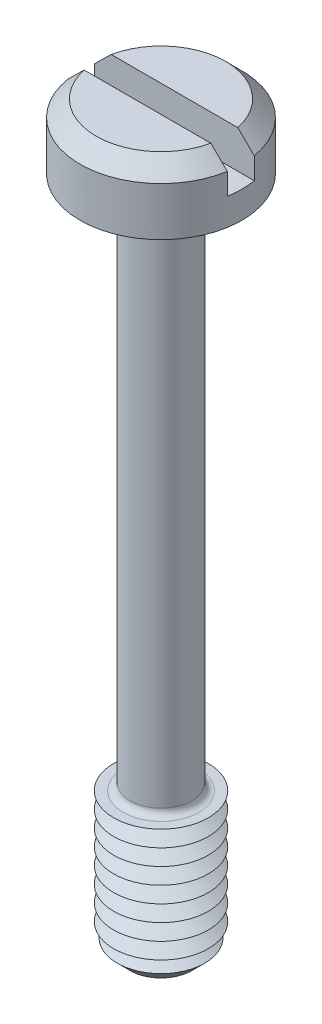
ISO-10303-21;
HEADER;
FILE_DESCRIPTION(('STEP AP214'),'2;1');
FILE_NAME('part.step','',(''),(''),'','','');
FILE_SCHEMA(('AUTOMOTIVE_DESIGN { 1 0 10303 214 1 1 1 1 }'));
ENDSEC;
DATA;
#1=APPLICATION_CONTEXT('core data for automotive mechanical design processes');
#2=APPLICATION_PROTOCOL_DEFINITION('international standard','automotive_design',2000,#1);
#3=PRODUCT_CONTEXT('',#1,'mechanical');
#4=PRODUCT('Part','Part','',(#3));
#5=PRODUCT_RELATED_PRODUCT_CATEGORY('part','',(#4));
#6=PRODUCT_DEFINITION_FORMATION('','',#4);
#7=PRODUCT_DEFINITION_CONTEXT('part definition',#1,'design');
#8=PRODUCT_DEFINITION('design','',#6,#7);
#9=PRODUCT_DEFINITION_SHAPE('','',#8);
#10=(LENGTH_UNIT() NAMED_UNIT(*) SI_UNIT(.MILLI.,.METRE.));
#11=(NAMED_UNIT(*) PLANE_ANGLE_UNIT() SI_UNIT($,.RADIAN.));
#12=(NAMED_UNIT(*) SI_UNIT($,.STERADIAN.) SOLID_ANGLE_UNIT());
#13=UNCERTAINTY_MEASURE_WITH_UNIT(LENGTH_MEASURE(1.E-05),#10,'distance_accuracy_value','');
#14=(GEOMETRIC_REPRESENTATION_CONTEXT(3) GLOBAL_UNCERTAINTY_ASSIGNED_CONTEXT((#13)) GLOBAL_UNIT_ASSIGNED_CONTEXT((#10,
#11,#12)) REPRESENTATION_CONTEXT('',''));
#15=CARTESIAN_POINT('',(0.,0.,0.));
#16=DIRECTION('',(0.,0.,1.));
#17=DIRECTION('',(1.,0.,0.));
#18=AXIS2_PLACEMENT_3D('',#15,#16,#17);
#19=CARTESIAN_POINT('',(0.,2.4,0.));
#20=DIRECTION('',(0.,1.,0.));
#21=DIRECTION('',(0.,0.,1.));
#22=AXIS2_PLACEMENT_3D('',#19,#20,#21);
#23=PLANE('',#22);
#24=DIRECTION('',(-1.,0.,0.));
#25=VECTOR('',#24,1.);
#26=CARTESIAN_POINT('',(3.,2.4,-0.5));
#27=LINE('',#26,#25);
#28=CARTESIAN_POINT('',(2.3473389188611,2.4,-0.5));
#29=VERTEX_POINT('',#28);
#30=CARTESIAN_POINT('',(-2.3473389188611,2.4,-0.5));
#31=VERTEX_POINT('',#30);
#32=EDGE_CURVE('E110',#29,#31,#27,.T.);
#33=ORIENTED_EDGE('',*,*,#32,.F.);
#34=CARTESIAN_POINT('',(0.,2.4,0.));
#35=DIRECTION('',(0.,1.,0.));
#36=DIRECTION('',(0.,0.,1.));
#37=AXIS2_PLACEMENT_3D('',#34,#35,#36);
#38=CIRCLE('',#37,2.4);
#39=EDGE_CURVE('E113',#29,#31,#38,.T.);
#40=ORIENTED_EDGE('',*,*,#39,.T.);
#41=EDGE_LOOP('',(#33,#40));
#42=FACE_BOUND('',#41,.T.);
#43=ADVANCED_FACE('F39',(#42),#23,.T.);
#44=CARTESIAN_POINT('',(0.,2.4,0.));
#45=DIRECTION('',(0.,-1.,0.));
#46=DIRECTION('',(0.,0.,-1.));
#47=AXIS2_PLACEMENT_3D('',#44,#45,#46);
#48=CONICAL_SURFACE('',#47,2.4,0.785398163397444);
#49=CARTESIAN_POINT('',(6.59924075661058,-1.81815522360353,-0.5));
#50=CARTESIAN_POINT('',(6.36552831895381,-1.58511655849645,-0.5));
#51=CARTESIAN_POINT('',(6.13178603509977,-1.3521077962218,-0.5));
#52=CARTESIAN_POINT('',(5.66419282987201,-0.886182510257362,-0.5));
#53=CARTESIAN_POINT('',(5.43034190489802,-0.65326599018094,-0.5));
#54=CARTESIAN_POINT('',(4.9622949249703,-0.187370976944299,-0.5));
#55=CARTESIAN_POINT('',(4.72809874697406,0.0456073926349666,-0.5));
#56=CARTESIAN_POINT('',(4.25949632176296,0.51133642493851,-0.5));
#57=CARTESIAN_POINT('',(4.02509008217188,0.744087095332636,-0.5));
#58=CARTESIAN_POINT('',(3.56605462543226,1.19918528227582,-0.5));
#59=CARTESIAN_POINT('',(3.34144041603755,1.42154792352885,-0.5));
#60=CARTESIAN_POINT('',(3.0040669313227,1.75465797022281,-0.5));
#61=CARTESIAN_POINT('',(2.89152775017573,1.8656282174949,-0.5));
#62=CARTESIAN_POINT('',(2.66624137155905,2.0873550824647,-0.5));
#63=CARTESIAN_POINT('',(2.5534941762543,2.19811170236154,-0.5));
#64=CARTESIAN_POINT('',(2.32775708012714,2.41925708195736,-0.5));
#65=CARTESIAN_POINT('',(2.21476734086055,2.52964600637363,-0.5));
#66=CARTESIAN_POINT('',(1.98831594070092,2.74994787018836,-0.5));
#67=CARTESIAN_POINT('',(1.87485426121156,2.85986079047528,-0.5));
#68=CARTESIAN_POINT('',(1.64719242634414,3.07888083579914,-0.5));
#69=CARTESIAN_POINT('',(1.53299241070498,3.18798810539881,-0.5));
#70=CARTESIAN_POINT('',(1.3606375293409,3.35052419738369,-0.5));
#71=CARTESIAN_POINT('',(1.30301197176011,3.40451369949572,-0.5));
#72=CARTESIAN_POINT('',(1.18725070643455,3.51194233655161,-0.5));
#73=CARTESIAN_POINT('',(1.12911501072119,3.56538148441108,-0.5));
#74=CARTESIAN_POINT('',(1.0381044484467,3.64783932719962,-0.5));
#75=CARTESIAN_POINT('',(1.0054935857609,3.67714917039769,-0.5));
#76=CARTESIAN_POINT('',(0.939964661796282,3.73543047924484,-0.5));
#77=CARTESIAN_POINT('',(0.907046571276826,3.76440191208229,-0.5));
#78=CARTESIAN_POINT('',(0.840581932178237,3.82209234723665,-0.5));
#79=CARTESIAN_POINT('',(0.807032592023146,3.85080814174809,-0.5));
#80=CARTESIAN_POINT('',(0.739406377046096,3.90759649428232,-0.5));
#81=CARTESIAN_POINT('',(0.705329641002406,3.93566921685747,-0.5));
#82=CARTESIAN_POINT('',(0.636165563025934,3.9911274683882,-0.5));
#83=CARTESIAN_POINT('',(0.601072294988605,4.01850564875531,-0.5));
#84=CARTESIAN_POINT('',(0.529844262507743,4.07186782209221,-0.5));
#85=CARTESIAN_POINT('',(0.493709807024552,4.09785222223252,-0.5));
#86=CARTESIAN_POINT('',(0.420142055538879,4.14747983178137,-0.5));
#87=CARTESIAN_POINT('',(0.382717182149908,4.17113535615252,-0.5));
#88=CARTESIAN_POINT('',(0.305809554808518,4.2147521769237,-0.5));
#89=CARTESIAN_POINT('',(0.266332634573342,4.23472328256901,-0.5));
#90=CARTESIAN_POINT('',(0.1948636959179,4.26409059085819,-0.5));
#91=CARTESIAN_POINT('',(0.163467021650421,4.27488228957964,-0.5));
#92=CARTESIAN_POINT('',(0.0993951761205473,4.29114651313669,-0.5));
#93=CARTESIAN_POINT('',(0.0667267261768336,4.29664386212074,-0.5));
#94=CARTESIAN_POINT('',(0.00059647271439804,4.30109247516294,-0.5));
#95=CARTESIAN_POINT('',(-0.0328699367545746,4.29998037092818,-0.5));
#96=CARTESIAN_POINT('',(-0.099020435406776,4.29135963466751,-0.5));
#97=CARTESIAN_POINT('',(-0.131701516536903,4.28382951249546,-0.5));
#98=CARTESIAN_POINT('',(-0.187595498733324,4.26645763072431,-0.5));
#99=CARTESIAN_POINT('',(-0.21115132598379,4.25764794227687,-0.5));
#100=CARTESIAN_POINT('',(-0.257419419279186,4.2380158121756,-0.5));
#101=CARTESIAN_POINT('',(-0.280131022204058,4.22719182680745,-0.5));
#102=CARTESIAN_POINT('',(-0.324887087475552,4.20402808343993,-0.5));
#103=CARTESIAN_POINT('',(-0.346927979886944,4.19168154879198,-0.5));
#104=CARTESIAN_POINT('',(-0.390350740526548,4.16590953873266,-0.5));
#105=CARTESIAN_POINT('',(-0.411732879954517,4.15248451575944,-0.5));
#106=CARTESIAN_POINT('',(-0.483200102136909,4.10572719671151,-0.5));
#107=CARTESIAN_POINT('',(-0.532069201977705,4.0705493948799,-0.5));
#108=CARTESIAN_POINT('',(-0.628034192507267,3.99783710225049,-0.5));
#109=CARTESIAN_POINT('',(-0.675128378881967,3.96030043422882,-0.5));
#110=CARTESIAN_POINT('',(-0.768277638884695,3.8837323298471,-0.5));
#111=CARTESIAN_POINT('',(-0.814329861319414,3.84469743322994,-0.5));
#112=CARTESIAN_POINT('',(-0.905640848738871,3.76575507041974,-0.5));
#113=CARTESIAN_POINT('',(-0.950899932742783,3.72584797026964,-0.5));
#114=CARTESIAN_POINT('',(-1.04097019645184,3.64535266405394,-0.5));
#115=CARTESIAN_POINT('',(-1.08578029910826,3.60476325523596,-0.5));
#116=CARTESIAN_POINT('',(-1.17501433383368,3.52315414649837,-0.5));
#117=CARTESIAN_POINT('',(-1.21943822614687,3.48213440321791,-0.5));
#118=CARTESIAN_POINT('',(-1.35214179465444,3.35874463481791,-0.5));
#119=CARTESIAN_POINT('',(-1.43999477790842,3.27591618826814,-0.5));
#120=CARTESIAN_POINT('',(-1.61421087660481,3.11033648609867,-0.5));
#121=CARTESIAN_POINT('',(-1.70058023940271,3.02759177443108,-0.5));
#122=CARTESIAN_POINT('',(-1.87288923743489,2.86165572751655,-0.5));
#123=CARTESIAN_POINT('',(-1.95882887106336,2.77846439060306,-0.5));
#124=CARTESIAN_POINT('',(-2.2162249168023,2.52844403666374,-0.5));
#125=CARTESIAN_POINT('',(-2.3872526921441,2.36117421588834,-0.5));
#126=CARTESIAN_POINT('',(-2.72882612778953,2.025931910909,-0.5));
#127=CARTESIAN_POINT('',(-2.89937142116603,1.85795905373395,-0.5));
#128=CARTESIAN_POINT('',(-3.24010524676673,1.5216572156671,-0.5));
#129=CARTESIAN_POINT('',(-3.41029378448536,1.35332824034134,-0.5));
#130=CARTESIAN_POINT('',(-3.75003309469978,1.01685288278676,-0.5));
#131=CARTESIAN_POINT('',(-3.91958441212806,0.848707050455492,-0.5));
#132=CARTESIAN_POINT('',(-4.25853538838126,0.512261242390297,-0.5));
#133=CARTESIAN_POINT('',(-4.42793504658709,0.343961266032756,-0.5));
#134=CARTESIAN_POINT('',(-4.93592097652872,-0.161044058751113,-0.5));
#135=CARTESIAN_POINT('',(-5.27434871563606,-0.497908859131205,-0.5));
#136=CARTESIAN_POINT('',(-5.69486651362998,-0.916769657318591,-0.5));
#137=CARTESIAN_POINT('',(-5.77706453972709,-0.998657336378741,-0.5));
#138=CARTESIAN_POINT('',(-5.94145013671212,-1.16244746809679,-0.5));
#139=CARTESIAN_POINT('',(-6.02363770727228,-1.2443499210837,-0.5));
#140=CARTESIAN_POINT('',(-6.18806790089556,-1.40823159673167,-0.5));
#141=CARTESIAN_POINT('',(-6.27031051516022,-1.49021082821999,-0.5));
#142=CARTESIAN_POINT('',(-6.43478378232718,-1.65417699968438,-0.5));
#143=CARTESIAN_POINT('',(-6.51701443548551,-1.73616393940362,-0.5));
#144=CARTESIAN_POINT('',(-6.59924075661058,-1.81815522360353,-0.5));
#145=B_SPLINE_CURVE_WITH_KNOTS('',3,(#49,#50,#51,#52,#53,#54,#55,#56,#57,#58,#59,#60,#61,#62,
#63,#64,#65,#66,#67,#68,#69,#70,#71,#72,#73,#74,#75,#76,#77,#78,#79,#80,#81,#82,#83,#84,#85,#86,
#87,#88,#89,#90,#91,#92,#93,#94,#95,#96,#97,#98,#99,#100,#101,#102,#103,#104,#105,#106,#107,
#108,#109,#110,#111,#112,#113,#114,#115,#116,#117,#118,#119,#120,#121,#122,#123,#124,#125,#126,
#127,#128,#129,#130,#131,#132,#133,#134,#135,#136,#137,#138,#139,#140,#141,#142,#143,#144),
.UNSPECIFIED.,.F.,.F.,(4,2,2,2,2,2,2,2,2,2,2,2,2,2,2,2,2,2,2,2,2,2,2,2,2,2,2,2,2,2,2,2,2,2,2,2,
2,2,2,2,2,2,2,2,2,2,2,4),(0.,0.990129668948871,1.98029489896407,2.9713250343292,
3.96232055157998,4.91051293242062,5.38465950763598,5.8588011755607,6.33268991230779,
6.80659750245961,7.28041788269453,7.51731276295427,7.75420207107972,7.88574051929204,
8.01729161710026,8.14976780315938,8.28220970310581,8.41571746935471,8.54918601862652,
8.68190589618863,8.81426715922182,8.91354607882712,9.01235719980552,9.1121171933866,
9.21221254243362,9.28755627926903,9.36295799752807,9.43870832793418,9.51442704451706,
9.69490147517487,9.87554500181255,10.0566343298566,10.2376490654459,10.4190258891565,
10.6004211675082,10.9626397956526,11.3214656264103,11.6802927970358,12.3979711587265,
13.1160968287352,13.8342113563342,14.5505812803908,15.2669541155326,16.6994694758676,
17.0475484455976,17.3956364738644,17.7440040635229,18.0923625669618),.UNSPECIFIED.);
#146=CARTESIAN_POINT('',(2.95803989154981,1.8,-0.5));
#147=VERTEX_POINT('',#146);
#148=EDGE_CURVE('E260',#147,#29,#145,.T.);
#149=ORIENTED_EDGE('',*,*,#148,.F.);
#150=CARTESIAN_POINT('',(0.,1.8,0.));
#151=DIRECTION('',(0.,1.,0.));
#152=DIRECTION('',(0.,0.,1.));
#153=AXIS2_PLACEMENT_3D('',#150,#151,#152);
#154=CIRCLE('',#153,3.);
#155=CARTESIAN_POINT('',(-2.95803989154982,1.79999999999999,-0.5));
#156=VERTEX_POINT('',#155);
#157=EDGE_CURVE('E128',#156,#147,#154,.F.);
#158=ORIENTED_EDGE('',*,*,#157,.F.);
#159=EDGE_CURVE('E102',#31,#156,#145,.T.);
#160=ORIENTED_EDGE('',*,*,#159,.F.);
#161=ORIENTED_EDGE('',*,*,#39,.F.);
#162=EDGE_LOOP('',(#149,#158,#160,#161));
#163=FACE_BOUND('',#162,.T.);
#164=ADVANCED_FACE('F222',(#163),#48,.T.);
#165=CARTESIAN_POINT('',(0.,-25.,0.));
#166=DIRECTION('',(0.,1.,0.));
#167=DIRECTION('',(0.,0.,1.));
#168=AXIS2_PLACEMENT_3D('',#165,#166,#167);
#169=CYLINDRICAL_SURFACE('',#168,1.15);
#170=CARTESIAN_POINT('',(0.,-19.55,0.));
#171=DIRECTION('',(0.,-1.,0.));
#172=DIRECTION('',(0.,0.,-1.));
#173=AXIS2_PLACEMENT_3D('',#170,#171,#172);
#174=CIRCLE('',#173,1.15);
#175=CARTESIAN_POINT('',(0.,-19.55,-1.15));
#176=VERTEX_POINT('',#175);
#177=EDGE_CURVE('E123',#176,#176,#174,.F.);
#178=ORIENTED_EDGE('',*,*,#177,.T.);
#179=EDGE_LOOP('',(#178));
#180=FACE_BOUND('',#179,.T.);
#181=CARTESIAN_POINT('',(0.,-0.25,0.));
#182=DIRECTION('',(0.,1.,0.));
#183=DIRECTION('',(0.,0.,1.));
#184=AXIS2_PLACEMENT_3D('',#181,#182,#183);
#185=CIRCLE('',#184,1.15);
#186=CARTESIAN_POINT('',(0.,-0.25,1.15));
#187=VERTEX_POINT('',#186);
#188=EDGE_CURVE('E366',#187,#187,#185,.F.);
#189=ORIENTED_EDGE('',*,*,#188,.T.);
#190=EDGE_LOOP('',(#189));
#191=FACE_BOUND('',#190,.T.);
#192=ADVANCED_FACE('F218',(#180,#191),#169,.T.);
#193=CARTESIAN_POINT('',(0.,2.4,0.));
#194=DIRECTION('',(0.,-1.,0.));
#195=DIRECTION('',(0.,0.,-1.));
#196=AXIS2_PLACEMENT_3D('',#193,#194,#195);
#197=CYLINDRICAL_SURFACE('',#196,3.);
#198=ORIENTED_EDGE('',*,*,#157,.T.);
#199=DIRECTION('',(0.,-1.,0.));
#200=VECTOR('',#199,1.);
#201=CARTESIAN_POINT('',(2.95803989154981,2.4,-0.5));
#202=LINE('',#201,#200);
#203=CARTESIAN_POINT('',(2.95803989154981,1.,-0.5));
#204=VERTEX_POINT('',#203);
#205=EDGE_CURVE('E64',#147,#204,#202,.T.);
#206=ORIENTED_EDGE('',*,*,#205,.T.);
#207=CARTESIAN_POINT('',(0.,1.,0.));
#208=DIRECTION('',(0.,1.,0.));
#209=DIRECTION('',(0.,0.,1.));
#210=AXIS2_PLACEMENT_3D('',#207,#208,#209);
#211=CIRCLE('',#210,3.);
#212=CARTESIAN_POINT('',(2.95803989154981,1.,0.5));
#213=VERTEX_POINT('',#212);
#214=EDGE_CURVE('E11',#213,#204,#211,.T.);
#215=ORIENTED_EDGE('',*,*,#214,.F.);
#216=DIRECTION('',(0.,-1.,0.));
#217=VECTOR('',#216,1.);
#218=CARTESIAN_POINT('',(2.95803989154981,2.4,0.5));
#219=LINE('',#218,#217);
#220=CARTESIAN_POINT('',(2.95803989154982,1.79999999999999,0.5));
#221=VERTEX_POINT('',#220);
#222=EDGE_CURVE('E276',#213,#221,#219,.F.);
#223=ORIENTED_EDGE('',*,*,#222,.T.);
#224=CARTESIAN_POINT('',(-2.95803989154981,1.8,0.5));
#225=VERTEX_POINT('',#224);
#226=EDGE_CURVE('E120',#221,#225,#154,.F.);
#227=ORIENTED_EDGE('',*,*,#226,.T.);
#228=DIRECTION('',(0.,-1.,0.));
#229=VECTOR('',#228,1.);
#230=CARTESIAN_POINT('',(-2.95803989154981,2.4,0.5));
#231=LINE('',#230,#229);
#232=CARTESIAN_POINT('',(-2.95803989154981,1.,0.5));
#233=VERTEX_POINT('',#232);
#234=EDGE_CURVE('E96',#225,#233,#231,.T.);
#235=ORIENTED_EDGE('',*,*,#234,.T.);
#236=CARTESIAN_POINT('',(-2.95803989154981,1.,-0.5));
#237=VERTEX_POINT('',#236);
#238=EDGE_CURVE('E44',#237,#233,#211,.T.);
#239=ORIENTED_EDGE('',*,*,#238,.F.);
#240=DIRECTION('',(0.,-1.,0.));
#241=VECTOR('',#240,1.);
#242=CARTESIAN_POINT('',(-2.95803989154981,2.4,-0.5));
#243=LINE('',#242,#241);
#244=EDGE_CURVE('E281',#237,#156,#243,.F.);
#245=ORIENTED_EDGE('',*,*,#244,.T.);
#246=EDGE_LOOP('',(#198,#206,#215,#223,#227,#235,#239,#245));
#247=FACE_BOUND('',#246,.T.);
#248=CARTESIAN_POINT('',(0.,0.,0.));
#249=DIRECTION('',(0.,1.,0.));
#250=DIRECTION('',(0.,0.,1.));
#251=AXIS2_PLACEMENT_3D('',#248,#249,#250);
#252=CIRCLE('',#251,3.);
#253=CARTESIAN_POINT('',(0.,0.,3.));
#254=VERTEX_POINT('',#253);
#255=EDGE_CURVE('E352',#254,#254,#252,.T.);
#256=ORIENTED_EDGE('',*,*,#255,.T.);
#257=EDGE_LOOP('',(#256));
#258=FACE_BOUND('',#257,.T.);
#259=ADVANCED_FACE('F221',(#247,#258),#197,.T.);
#260=DIRECTION('',(1.,0.,0.));
#261=VECTOR('',#260,1.);
#262=CARTESIAN_POINT('',(3.,2.4,0.5));
#263=LINE('',#262,#261);
#264=CARTESIAN_POINT('',(-2.3473389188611,2.4,0.5));
#265=VERTEX_POINT('',#264);
#266=CARTESIAN_POINT('',(2.3473389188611,2.4,0.5));
#267=VERTEX_POINT('',#266);
#268=EDGE_CURVE('E56',#265,#267,#263,.T.);
#269=ORIENTED_EDGE('',*,*,#268,.F.);
#270=EDGE_CURVE('E108',#265,#267,#38,.T.);
#271=ORIENTED_EDGE('',*,*,#270,.T.);
#272=EDGE_LOOP('',(#269,#271));
#273=FACE_BOUND('',#272,.T.);
#274=ADVANCED_FACE('F107',(#273),#23,.T.);
#275=CARTESIAN_POINT('',(0.,0.,0.));
#276=DIRECTION('',(0.,1.,0.));
#277=DIRECTION('',(0.,0.,1.));
#278=AXIS2_PLACEMENT_3D('',#275,#276,#277);
#279=PLANE('',#278);
#280=CARTESIAN_POINT('',(0.,0.,0.));
#281=DIRECTION('',(0.,1.,0.));
#282=DIRECTION('',(0.,0.,1.));
#283=AXIS2_PLACEMENT_3D('',#280,#281,#282);
#284=CIRCLE('',#283,1.4);
#285=CARTESIAN_POINT('',(0.,0.,1.4));
#286=VERTEX_POINT('',#285);
#287=EDGE_CURVE('E114',#286,#286,#284,.T.);
#288=ORIENTED_EDGE('',*,*,#287,.T.);
#289=EDGE_LOOP('',(#288));
#290=FACE_BOUND('',#289,.T.);
#291=ORIENTED_EDGE('',*,*,#255,.F.);
#292=EDGE_LOOP('',(#291));
#293=FACE_BOUND('',#292,.T.);
#294=ADVANCED_FACE('F212',(#290,#293),#279,.F.);
#295=CARTESIAN_POINT('',(0.,-19.8,0.));
#296=DIRECTION('',(0.,-1.,0.));
#297=DIRECTION('',(0.,0.,-1.));
#298=AXIS2_PLACEMENT_3D('',#295,#296,#297);
#299=PLANE('',#298);
#300=CARTESIAN_POINT('',(0.,-19.8,0.));
#301=DIRECTION('',(0.,-1.,0.));
#302=DIRECTION('',(0.,0.,-1.));
#303=AXIS2_PLACEMENT_3D('',#300,#301,#302);
#304=CIRCLE('',#303,1.4);
#305=CARTESIAN_POINT('',(0.,-19.8,-1.4));
#306=VERTEX_POINT('',#305);
#307=EDGE_CURVE('E360',#306,#306,#304,.T.);
#308=ORIENTED_EDGE('',*,*,#307,.T.);
#309=EDGE_LOOP('',(#308));
#310=FACE_BOUND('',#309,.T.);
#311=CARTESIAN_POINT('',(0.,-19.8,0.));
#312=DIRECTION('',(0.,1.,0.));
#313=DIRECTION('',(0.,0.,1.));
#314=AXIS2_PLACEMENT_3D('',#311,#312,#313);
#315=CIRCLE('',#314,1.75);
#316=CARTESIAN_POINT('',(0.,-19.8,1.75));
#317=VERTEX_POINT('',#316);
#318=EDGE_CURVE('E349',#317,#317,#315,.T.);
#319=ORIENTED_EDGE('',*,*,#318,.T.);
#320=EDGE_LOOP('',(#319));
#321=FACE_BOUND('',#320,.T.);
#322=ADVANCED_FACE('F208',(#310,#321),#299,.F.);
#323=CARTESIAN_POINT('',(0.,-20.1,0.));
#324=DIRECTION('',(0.,1.,0.));
#325=DIRECTION('',(0.,0.,1.));
#326=AXIS2_PLACEMENT_3D('',#323,#324,#325);
#327=CONICAL_SURFACE('',#326,1.23038475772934,1.0471975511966);
#328=ORIENTED_EDGE('',*,*,#318,.F.);
#329=EDGE_LOOP('',(#328));
#330=FACE_BOUND('',#329,.T.);
#331=CARTESIAN_POINT('',(0.,-20.1,0.));
#332=DIRECTION('',(0.,1.,0.));
#333=DIRECTION('',(0.,0.,1.));
#334=AXIS2_PLACEMENT_3D('',#331,#332,#333);
#335=CIRCLE('',#334,1.23038475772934);
#336=CARTESIAN_POINT('',(0.,-20.1,1.23038475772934));
#337=VERTEX_POINT('',#336);
#338=EDGE_CURVE('E345',#337,#337,#335,.T.);
#339=ORIENTED_EDGE('',*,*,#338,.T.);
#340=EDGE_LOOP('',(#339));
#341=FACE_BOUND('',#340,.T.);
#342=ADVANCED_FACE('F204',(#330,#341),#327,.T.);
#343=CARTESIAN_POINT('',(0.,-20.4,0.));
#344=DIRECTION('',(0.,-1.,0.));
#345=DIRECTION('',(0.,0.,-1.));
#346=AXIS2_PLACEMENT_3D('',#343,#344,#345);
#347=CONICAL_SURFACE('',#346,1.75,1.0471975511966);
#348=ORIENTED_EDGE('',*,*,#338,.F.);
#349=EDGE_LOOP('',(#348));
#350=FACE_BOUND('',#349,.T.);
#351=CARTESIAN_POINT('',(0.,-20.4,0.));
#352=DIRECTION('',(0.,1.,0.));
#353=DIRECTION('',(0.,0.,1.));
#354=AXIS2_PLACEMENT_3D('',#351,#352,#353);
#355=CIRCLE('',#354,1.75);
#356=CARTESIAN_POINT('',(0.,-20.4,1.75));
#357=VERTEX_POINT('',#356);
#358=EDGE_CURVE('E341',#357,#357,#355,.T.);
#359=ORIENTED_EDGE('',*,*,#358,.T.);
#360=EDGE_LOOP('',(#359));
#361=FACE_BOUND('',#360,.T.);
#362=ADVANCED_FACE('F200',(#350,#361),#347,.T.);
#363=CARTESIAN_POINT('',(0.,-20.7,0.));
#364=DIRECTION('',(0.,1.,0.));
#365=DIRECTION('',(0.,0.,1.));
#366=AXIS2_PLACEMENT_3D('',#363,#364,#365);
#367=CONICAL_SURFACE('',#366,1.23038475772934,1.0471975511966);
#368=ORIENTED_EDGE('',*,*,#358,.F.);
#369=EDGE_LOOP('',(#368));
#370=FACE_BOUND('',#369,.T.);
#371=CARTESIAN_POINT('',(0.,-20.7,0.));
#372=DIRECTION('',(0.,1.,0.));
#373=DIRECTION('',(0.,0.,1.));
#374=AXIS2_PLACEMENT_3D('',#371,#372,#373);
#375=CIRCLE('',#374,1.23038475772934);
#376=CARTESIAN_POINT('',(0.,-20.7,1.23038475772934));
#377=VERTEX_POINT('',#376);
#378=EDGE_CURVE('E338',#377,#377,#375,.T.);
#379=ORIENTED_EDGE('',*,*,#378,.T.);
#380=EDGE_LOOP('',(#379));
#381=FACE_BOUND('',#380,.T.);
#382=ADVANCED_FACE('F196',(#370,#381),#367,.T.);
#383=CARTESIAN_POINT('',(0.,-21.,0.));
#384=DIRECTION('',(0.,-1.,0.));
#385=DIRECTION('',(0.,0.,-1.));
#386=AXIS2_PLACEMENT_3D('',#383,#384,#385);
#387=CONICAL_SURFACE('',#386,1.75,1.0471975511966);
#388=ORIENTED_EDGE('',*,*,#378,.F.);
#389=EDGE_LOOP('',(#388));
#390=FACE_BOUND('',#389,.T.);
#391=CARTESIAN_POINT('',(0.,-21.,0.));
#392=DIRECTION('',(0.,1.,0.));
#393=DIRECTION('',(0.,0.,1.));
#394=AXIS2_PLACEMENT_3D('',#391,#392,#393);
#395=CIRCLE('',#394,1.75);
#396=CARTESIAN_POINT('',(0.,-21.,1.75));
#397=VERTEX_POINT('',#396);
#398=EDGE_CURVE('E335',#397,#397,#395,.T.);
#399=ORIENTED_EDGE('',*,*,#398,.T.);
#400=EDGE_LOOP('',(#399));
#401=FACE_BOUND('',#400,.T.);
#402=ADVANCED_FACE('F192',(#390,#401),#387,.T.);
#403=CARTESIAN_POINT('',(0.,-21.3,0.));
#404=DIRECTION('',(0.,1.,0.));
#405=DIRECTION('',(0.,0.,1.));
#406=AXIS2_PLACEMENT_3D('',#403,#404,#405);
#407=CONICAL_SURFACE('',#406,1.23038475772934,1.0471975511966);
#408=ORIENTED_EDGE('',*,*,#398,.F.);
#409=EDGE_LOOP('',(#408));
#410=FACE_BOUND('',#409,.T.);
#411=CARTESIAN_POINT('',(0.,-21.3,0.));
#412=DIRECTION('',(0.,1.,0.));
#413=DIRECTION('',(0.,0.,1.));
#414=AXIS2_PLACEMENT_3D('',#411,#412,#413);
#415=CIRCLE('',#414,1.23038475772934);
#416=CARTESIAN_POINT('',(0.,-21.3,1.23038475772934));
#417=VERTEX_POINT('',#416);
#418=EDGE_CURVE('E331',#417,#417,#415,.T.);
#419=ORIENTED_EDGE('',*,*,#418,.T.);
#420=EDGE_LOOP('',(#419));
#421=FACE_BOUND('',#420,.T.);
#422=ADVANCED_FACE('F188',(#410,#421),#407,.T.);
#423=CARTESIAN_POINT('',(0.,-21.6,0.));
#424=DIRECTION('',(0.,-1.,0.));
#425=DIRECTION('',(0.,0.,-1.));
#426=AXIS2_PLACEMENT_3D('',#423,#424,#425);
#427=CONICAL_SURFACE('',#426,1.75,1.0471975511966);
#428=ORIENTED_EDGE('',*,*,#418,.F.);
#429=EDGE_LOOP('',(#428));
#430=FACE_BOUND('',#429,.T.);
#431=CARTESIAN_POINT('',(0.,-21.6,0.));
#432=DIRECTION('',(0.,1.,0.));
#433=DIRECTION('',(0.,0.,1.));
#434=AXIS2_PLACEMENT_3D('',#431,#432,#433);
#435=CIRCLE('',#434,1.75);
#436=CARTESIAN_POINT('',(0.,-21.6,1.75));
#437=VERTEX_POINT('',#436);
#438=EDGE_CURVE('E327',#437,#437,#435,.T.);
#439=ORIENTED_EDGE('',*,*,#438,.T.);
#440=EDGE_LOOP('',(#439));
#441=FACE_BOUND('',#440,.T.);
#442=ADVANCED_FACE('F184',(#430,#441),#427,.T.);
#443=CARTESIAN_POINT('',(0.,-21.9,0.));
#444=DIRECTION('',(0.,1.,0.));
#445=DIRECTION('',(0.,0.,1.));
#446=AXIS2_PLACEMENT_3D('',#443,#444,#445);
#447=CONICAL_SURFACE('',#446,1.23038475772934,1.0471975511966);
#448=ORIENTED_EDGE('',*,*,#438,.F.);
#449=EDGE_LOOP('',(#448));
#450=FACE_BOUND('',#449,.T.);
#451=CARTESIAN_POINT('',(0.,-21.9,0.));
#452=DIRECTION('',(0.,1.,0.));
#453=DIRECTION('',(0.,0.,1.));
#454=AXIS2_PLACEMENT_3D('',#451,#452,#453);
#455=CIRCLE('',#454,1.23038475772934);
#456=CARTESIAN_POINT('',(0.,-21.9,1.23038475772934));
#457=VERTEX_POINT('',#456);
#458=EDGE_CURVE('E323',#457,#457,#455,.T.);
#459=ORIENTED_EDGE('',*,*,#458,.T.);
#460=EDGE_LOOP('',(#459));
#461=FACE_BOUND('',#460,.T.);
#462=ADVANCED_FACE('F180',(#450,#461),#447,.T.);
#463=CARTESIAN_POINT('',(0.,-22.2,0.));
#464=DIRECTION('',(0.,-1.,0.));
#465=DIRECTION('',(0.,0.,-1.));
#466=AXIS2_PLACEMENT_3D('',#463,#464,#465);
#467=CONICAL_SURFACE('',#466,1.75,1.0471975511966);
#468=ORIENTED_EDGE('',*,*,#458,.F.);
#469=EDGE_LOOP('',(#468));
#470=FACE_BOUND('',#469,.T.);
#471=CARTESIAN_POINT('',(0.,-22.2,0.));
#472=DIRECTION('',(0.,1.,0.));
#473=DIRECTION('',(0.,0.,1.));
#474=AXIS2_PLACEMENT_3D('',#471,#472,#473);
#475=CIRCLE('',#474,1.75);
#476=CARTESIAN_POINT('',(0.,-22.2,1.75));
#477=VERTEX_POINT('',#476);
#478=EDGE_CURVE('E320',#477,#477,#475,.T.);
#479=ORIENTED_EDGE('',*,*,#478,.T.);
#480=EDGE_LOOP('',(#479));
#481=FACE_BOUND('',#480,.T.);
#482=ADVANCED_FACE('F176',(#470,#481),#467,.T.);
#483=CARTESIAN_POINT('',(0.,-22.5,0.));
#484=DIRECTION('',(0.,1.,0.));
#485=DIRECTION('',(0.,0.,1.));
#486=AXIS2_PLACEMENT_3D('',#483,#484,#485);
#487=CONICAL_SURFACE('',#486,1.23038475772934,1.0471975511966);
#488=ORIENTED_EDGE('',*,*,#478,.F.);
#489=EDGE_LOOP('',(#488));
#490=FACE_BOUND('',#489,.T.);
#491=CARTESIAN_POINT('',(0.,-22.5,0.));
#492=DIRECTION('',(0.,1.,0.));
#493=DIRECTION('',(0.,0.,1.));
#494=AXIS2_PLACEMENT_3D('',#491,#492,#493);
#495=CIRCLE('',#494,1.23038475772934);
#496=CARTESIAN_POINT('',(0.,-22.5,1.23038475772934));
#497=VERTEX_POINT('',#496);
#498=EDGE_CURVE('E316',#497,#497,#495,.T.);
#499=ORIENTED_EDGE('',*,*,#498,.T.);
#500=EDGE_LOOP('',(#499));
#501=FACE_BOUND('',#500,.T.);
#502=ADVANCED_FACE('F172',(#490,#501),#487,.T.);
#503=CARTESIAN_POINT('',(0.,-22.8,0.));
#504=DIRECTION('',(0.,-1.,0.));
#505=DIRECTION('',(0.,0.,-1.));
#506=AXIS2_PLACEMENT_3D('',#503,#504,#505);
#507=CONICAL_SURFACE('',#506,1.75,1.0471975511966);
#508=ORIENTED_EDGE('',*,*,#498,.F.);
#509=EDGE_LOOP('',(#508));
#510=FACE_BOUND('',#509,.T.);
#511=CARTESIAN_POINT('',(0.,-22.8,0.));
#512=DIRECTION('',(0.,1.,0.));
#513=DIRECTION('',(0.,0.,1.));
#514=AXIS2_PLACEMENT_3D('',#511,#512,#513);
#515=CIRCLE('',#514,1.75);
#516=CARTESIAN_POINT('',(0.,-22.8,1.75));
#517=VERTEX_POINT('',#516);
#518=EDGE_CURVE('E312',#517,#517,#515,.T.);
#519=ORIENTED_EDGE('',*,*,#518,.T.);
#520=EDGE_LOOP('',(#519));
#521=FACE_BOUND('',#520,.T.);
#522=ADVANCED_FACE('F168',(#510,#521),#507,.T.);
#523=CARTESIAN_POINT('',(0.,-23.1,0.));
#524=DIRECTION('',(0.,1.,0.));
#525=DIRECTION('',(0.,0.,1.));
#526=AXIS2_PLACEMENT_3D('',#523,#524,#525);
#527=CONICAL_SURFACE('',#526,1.23038475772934,1.0471975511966);
#528=ORIENTED_EDGE('',*,*,#518,.F.);
#529=EDGE_LOOP('',(#528));
#530=FACE_BOUND('',#529,.T.);
#531=CARTESIAN_POINT('',(0.,-23.1,0.));
#532=DIRECTION('',(0.,1.,0.));
#533=DIRECTION('',(0.,0.,1.));
#534=AXIS2_PLACEMENT_3D('',#531,#532,#533);
#535=CIRCLE('',#534,1.23038475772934);
#536=CARTESIAN_POINT('',(0.,-23.1,1.23038475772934));
#537=VERTEX_POINT('',#536);
#538=EDGE_CURVE('E308',#537,#537,#535,.T.);
#539=ORIENTED_EDGE('',*,*,#538,.T.);
#540=EDGE_LOOP('',(#539));
#541=FACE_BOUND('',#540,.T.);
#542=ADVANCED_FACE('F164',(#530,#541),#527,.T.);
#543=CARTESIAN_POINT('',(0.,-23.4,0.));
#544=DIRECTION('',(0.,-1.,0.));
#545=DIRECTION('',(0.,0.,-1.));
#546=AXIS2_PLACEMENT_3D('',#543,#544,#545);
#547=CONICAL_SURFACE('',#546,1.75,1.0471975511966);
#548=ORIENTED_EDGE('',*,*,#538,.F.);
#549=EDGE_LOOP('',(#548));
#550=FACE_BOUND('',#549,.T.);
#551=CARTESIAN_POINT('',(0.,-23.4,0.));
#552=DIRECTION('',(0.,1.,0.));
#553=DIRECTION('',(0.,0.,1.));
#554=AXIS2_PLACEMENT_3D('',#551,#552,#553);
#555=CIRCLE('',#554,1.75);
#556=CARTESIAN_POINT('',(0.,-23.4,1.75));
#557=VERTEX_POINT('',#556);
#558=EDGE_CURVE('E304',#557,#557,#555,.T.);
#559=ORIENTED_EDGE('',*,*,#558,.T.);
#560=EDGE_LOOP('',(#559));
#561=FACE_BOUND('',#560,.T.);
#562=ADVANCED_FACE('F160',(#550,#561),#547,.T.);
#563=CARTESIAN_POINT('',(0.,-23.7,0.));
#564=DIRECTION('',(0.,1.,0.));
#565=DIRECTION('',(0.,0.,1.));
#566=AXIS2_PLACEMENT_3D('',#563,#564,#565);
#567=CONICAL_SURFACE('',#566,1.23038475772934,1.0471975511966);
#568=ORIENTED_EDGE('',*,*,#558,.F.);
#569=EDGE_LOOP('',(#568));
#570=FACE_BOUND('',#569,.T.);
#571=CARTESIAN_POINT('',(0.,-23.7,0.));
#572=DIRECTION('',(0.,1.,0.));
#573=DIRECTION('',(0.,0.,1.));
#574=AXIS2_PLACEMENT_3D('',#571,#572,#573);
#575=CIRCLE('',#574,1.23038475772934);
#576=CARTESIAN_POINT('',(0.,-23.7,1.23038475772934));
#577=VERTEX_POINT('',#576);
#578=EDGE_CURVE('E300',#577,#577,#575,.T.);
#579=ORIENTED_EDGE('',*,*,#578,.T.);
#580=EDGE_LOOP('',(#579));
#581=FACE_BOUND('',#580,.T.);
#582=ADVANCED_FACE('F156',(#570,#581),#567,.T.);
#583=CARTESIAN_POINT('',(0.,-24.,0.));
#584=DIRECTION('',(0.,-1.,0.));
#585=DIRECTION('',(0.,0.,-1.));
#586=AXIS2_PLACEMENT_3D('',#583,#584,#585);
#587=CONICAL_SURFACE('',#586,1.75,1.0471975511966);
#588=ORIENTED_EDGE('',*,*,#578,.F.);
#589=EDGE_LOOP('',(#588));
#590=FACE_BOUND('',#589,.T.);
#591=CARTESIAN_POINT('',(0.,-24.,0.));
#592=DIRECTION('',(0.,1.,0.));
#593=DIRECTION('',(0.,0.,1.));
#594=AXIS2_PLACEMENT_3D('',#591,#592,#593);
#595=CIRCLE('',#594,1.75);
#596=CARTESIAN_POINT('',(0.,-24.,1.75));
#597=VERTEX_POINT('',#596);
#598=EDGE_CURVE('E295',#597,#597,#595,.T.);
#599=ORIENTED_EDGE('',*,*,#598,.T.);
#600=EDGE_LOOP('',(#599));
#601=FACE_BOUND('',#600,.T.);
#602=ADVANCED_FACE('F152',(#590,#601),#587,.T.);
#603=CARTESIAN_POINT('',(0.,-24.3,0.));
#604=DIRECTION('',(0.,1.,0.));
#605=DIRECTION('',(0.,0.,1.));
#606=AXIS2_PLACEMENT_3D('',#603,#604,#605);
#607=CONICAL_SURFACE('',#606,1.23038475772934,1.0471975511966);
#608=ORIENTED_EDGE('',*,*,#598,.F.);
#609=EDGE_LOOP('',(#608));
#610=FACE_BOUND('',#609,.T.);
#611=CARTESIAN_POINT('',(0.,-24.3,0.));
#612=DIRECTION('',(0.,1.,0.));
#613=DIRECTION('',(0.,0.,1.));
#614=AXIS2_PLACEMENT_3D('',#611,#612,#613);
#615=CIRCLE('',#614,1.23038475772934);
#616=CARTESIAN_POINT('',(0.,-24.3,1.23038475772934));
#617=VERTEX_POINT('',#616);
#618=EDGE_CURVE('E291',#617,#617,#615,.T.);
#619=ORIENTED_EDGE('',*,*,#618,.T.);
#620=EDGE_LOOP('',(#619));
#621=FACE_BOUND('',#620,.T.);
#622=ADVANCED_FACE('F148',(#610,#621),#607,.T.);
#623=CARTESIAN_POINT('',(0.,-24.6,0.));
#624=DIRECTION('',(0.,-1.,0.));
#625=DIRECTION('',(0.,0.,-1.));
#626=AXIS2_PLACEMENT_3D('',#623,#624,#625);
#627=CONICAL_SURFACE('',#626,1.75,1.0471975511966);
#628=CARTESIAN_POINT('',(0.,-24.5267949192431,0.));
#629=DIRECTION('',(0.,-1.,0.));
#630=DIRECTION('',(0.,0.,-1.));
#631=AXIS2_PLACEMENT_3D('',#628,#629,#630);
#632=CIRCLE('',#631,1.62320508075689);
#633=CARTESIAN_POINT('',(0.,-24.5267949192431,-1.62320508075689));
#634=VERTEX_POINT('',#633);
#635=EDGE_CURVE('E299',#634,#634,#632,.F.);
#636=ORIENTED_EDGE('',*,*,#635,.T.);
#637=EDGE_LOOP('',(#636));
#638=FACE_BOUND('',#637,.T.);
#639=ORIENTED_EDGE('',*,*,#618,.F.);
#640=EDGE_LOOP('',(#639));
#641=FACE_BOUND('',#640,.T.);
#642=ADVANCED_FACE('F144',(#638,#641),#627,.T.);
#643=CARTESIAN_POINT('',(0.,-25.,0.));
#644=DIRECTION('',(0.,-1.,0.));
#645=DIRECTION('',(0.,0.,-1.));
#646=AXIS2_PLACEMENT_3D('',#643,#644,#645);
#647=PLANE('',#646);
#648=CARTESIAN_POINT('',(0.,-25.,0.));
#649=DIRECTION('',(0.,-1.,0.));
#650=DIRECTION('',(0.,0.,-1.));
#651=AXIS2_PLACEMENT_3D('',#648,#649,#650);
#652=CIRCLE('',#651,1.15000000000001);
#653=CARTESIAN_POINT('',(0.,-25.,-1.15000000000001));
#654=VERTEX_POINT('',#653);
#655=EDGE_CURVE('E356',#654,#654,#652,.T.);
#656=ORIENTED_EDGE('',*,*,#655,.T.);
#657=EDGE_LOOP('',(#656));
#658=FACE_BOUND('',#657,.T.);
#659=ADVANCED_FACE('F147',(#658),#647,.T.);
#660=CARTESIAN_POINT('',(0.,-25.,0.));
#661=DIRECTION('',(0.,1.,0.));
#662=DIRECTION('',(0.,0.,1.));
#663=AXIS2_PLACEMENT_3D('',#660,#661,#662);
#664=CONICAL_SURFACE('',#663,1.15000000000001,0.785398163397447);
#665=ORIENTED_EDGE('',*,*,#635,.F.);
#666=EDGE_LOOP('',(#665));
#667=FACE_BOUND('',#666,.T.);
#668=ORIENTED_EDGE('',*,*,#655,.F.);
#669=EDGE_LOOP('',(#668));
#670=FACE_BOUND('',#669,.T.);
#671=ADVANCED_FACE('F216',(#667,#670),#664,.T.);
#672=CARTESIAN_POINT('',(0.,-19.55,0.));
#673=DIRECTION('',(0.,-1.,0.));
#674=DIRECTION('',(0.,0.,-1.));
#675=AXIS2_PLACEMENT_3D('',#672,#673,#674);
#676=TOROIDAL_SURFACE('',#675,1.4,0.25);
#677=ORIENTED_EDGE('',*,*,#177,.F.);
#678=EDGE_LOOP('',(#677));
#679=FACE_BOUND('',#678,.T.);
#680=ORIENTED_EDGE('',*,*,#307,.F.);
#681=EDGE_LOOP('',(#680));
#682=FACE_BOUND('',#681,.T.);
#683=ADVANCED_FACE('F234',(#679,#682),#676,.F.);
#684=CARTESIAN_POINT('',(0.,-0.25,0.));
#685=DIRECTION('',(0.,1.,0.));
#686=DIRECTION('',(0.,0.,1.));
#687=AXIS2_PLACEMENT_3D('',#684,#685,#686);
#688=TOROIDAL_SURFACE('',#687,1.4,0.25);
#689=ORIENTED_EDGE('',*,*,#287,.F.);
#690=EDGE_LOOP('',(#689));
#691=FACE_BOUND('',#690,.T.);
#692=ORIENTED_EDGE('',*,*,#188,.F.);
#693=EDGE_LOOP('',(#692));
#694=FACE_BOUND('',#693,.T.);
#695=ADVANCED_FACE('F237',(#691,#694),#688,.F.);
#696=CARTESIAN_POINT('',(-6.59924075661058,-1.81815522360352,0.5));
#697=CARTESIAN_POINT('',(-6.36552831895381,-1.58511655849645,0.5));
#698=CARTESIAN_POINT('',(-6.13178603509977,-1.3521077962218,0.5));
#699=CARTESIAN_POINT('',(-5.66419282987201,-0.886182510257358,0.5));
#700=CARTESIAN_POINT('',(-5.43034190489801,-0.653265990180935,0.5));
#701=CARTESIAN_POINT('',(-4.96229492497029,-0.187370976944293,0.5));
#702=CARTESIAN_POINT('',(-4.72809874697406,0.0456073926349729,0.5));
#703=CARTESIAN_POINT('',(-4.25949632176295,0.511336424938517,0.5));
#704=CARTESIAN_POINT('',(-4.02509008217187,0.744087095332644,0.5));
#705=CARTESIAN_POINT('',(-3.56605462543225,1.19918528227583,0.5));
#706=CARTESIAN_POINT('',(-3.34144041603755,1.42154792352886,0.5));
#707=CARTESIAN_POINT('',(-3.00406693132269,1.75465797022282,0.5));
#708=CARTESIAN_POINT('',(-2.89152775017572,1.8656282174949,0.5));
#709=CARTESIAN_POINT('',(-2.66624137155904,2.08735508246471,0.5));
#710=CARTESIAN_POINT('',(-2.5534941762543,2.19811170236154,0.5));
#711=CARTESIAN_POINT('',(-2.32775708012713,2.41925708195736,0.5));
#712=CARTESIAN_POINT('',(-2.21476734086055,2.52964600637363,0.5));
#713=CARTESIAN_POINT('',(-1.98831594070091,2.74994787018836,0.5));
#714=CARTESIAN_POINT('',(-1.87485426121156,2.85986079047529,0.5));
#715=CARTESIAN_POINT('',(-1.64719242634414,3.07888083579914,0.5));
#716=CARTESIAN_POINT('',(-1.53299241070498,3.18798810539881,0.5));
#717=CARTESIAN_POINT('',(-1.3606375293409,3.35052419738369,0.5));
#718=CARTESIAN_POINT('',(-1.30301197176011,3.40451369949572,0.5));
#719=CARTESIAN_POINT('',(-1.18725070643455,3.51194233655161,0.5));
#720=CARTESIAN_POINT('',(-1.12911501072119,3.56538148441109,0.5));
#721=CARTESIAN_POINT('',(-1.0381044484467,3.64783932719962,0.5));
#722=CARTESIAN_POINT('',(-1.0054935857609,3.67714917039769,0.5));
#723=CARTESIAN_POINT('',(-0.939964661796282,3.73543047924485,0.5));
#724=CARTESIAN_POINT('',(-0.907046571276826,3.76440191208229,0.5));
#725=CARTESIAN_POINT('',(-0.840581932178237,3.82209234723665,0.5));
#726=CARTESIAN_POINT('',(-0.807032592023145,3.85080814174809,0.5));
#727=CARTESIAN_POINT('',(-0.739406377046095,3.90759649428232,0.5));
#728=CARTESIAN_POINT('',(-0.705329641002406,3.93566921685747,0.5));
#729=CARTESIAN_POINT('',(-0.636165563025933,3.99112746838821,0.5));
#730=CARTESIAN_POINT('',(-0.601072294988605,4.01850564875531,0.5));
#731=CARTESIAN_POINT('',(-0.529844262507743,4.07186782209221,0.5));
#732=CARTESIAN_POINT('',(-0.493709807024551,4.09785222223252,0.5));
#733=CARTESIAN_POINT('',(-0.420142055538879,4.14747983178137,0.5));
#734=CARTESIAN_POINT('',(-0.382717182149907,4.17113535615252,0.5));
#735=CARTESIAN_POINT('',(-0.305809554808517,4.2147521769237,0.5));
#736=CARTESIAN_POINT('',(-0.266332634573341,4.23472328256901,0.5));
#737=CARTESIAN_POINT('',(-0.1948636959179,4.26409059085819,0.5));
#738=CARTESIAN_POINT('',(-0.163467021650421,4.27488228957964,0.5));
#739=CARTESIAN_POINT('',(-0.0993951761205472,4.29114651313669,0.5));
#740=CARTESIAN_POINT('',(-0.0667267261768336,4.29664386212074,0.5));
#741=CARTESIAN_POINT('',(-0.000596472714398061,4.30109247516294,0.5));
#742=CARTESIAN_POINT('',(0.0328699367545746,4.29998037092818,0.5));
#743=CARTESIAN_POINT('',(0.099020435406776,4.29135963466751,0.5));
#744=CARTESIAN_POINT('',(0.131701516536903,4.28382951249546,0.5));
#745=CARTESIAN_POINT('',(0.187595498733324,4.26645763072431,0.5));
#746=CARTESIAN_POINT('',(0.21115132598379,4.25764794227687,0.5));
#747=CARTESIAN_POINT('',(0.257419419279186,4.2380158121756,0.5));
#748=CARTESIAN_POINT('',(0.280131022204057,4.22719182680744,0.5));
#749=CARTESIAN_POINT('',(0.32488708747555,4.20402808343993,0.5));
#750=CARTESIAN_POINT('',(0.346927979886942,4.19168154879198,0.5));
#751=CARTESIAN_POINT('',(0.390350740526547,4.16590953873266,0.5));
#752=CARTESIAN_POINT('',(0.411732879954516,4.15248451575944,0.5));
#753=CARTESIAN_POINT('',(0.483200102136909,4.10572719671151,0.5));
#754=CARTESIAN_POINT('',(0.532069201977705,4.0705493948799,0.5));
#755=CARTESIAN_POINT('',(0.628034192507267,3.99783710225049,0.5));
#756=CARTESIAN_POINT('',(0.675128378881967,3.96030043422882,0.5));
#757=CARTESIAN_POINT('',(0.768277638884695,3.8837323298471,0.5));
#758=CARTESIAN_POINT('',(0.814329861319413,3.84469743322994,0.5));
#759=CARTESIAN_POINT('',(0.905640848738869,3.76575507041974,0.5));
#760=CARTESIAN_POINT('',(0.950899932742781,3.72584797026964,0.5));
#761=CARTESIAN_POINT('',(1.04097019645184,3.64535266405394,0.5));
#762=CARTESIAN_POINT('',(1.08578029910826,3.60476325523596,0.5));
#763=CARTESIAN_POINT('',(1.17501433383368,3.52315414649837,0.5));
#764=CARTESIAN_POINT('',(1.21943822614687,3.48213440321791,0.5));
#765=CARTESIAN_POINT('',(1.35214179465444,3.35874463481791,0.5));
#766=CARTESIAN_POINT('',(1.43999477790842,3.27591618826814,0.5));
#767=CARTESIAN_POINT('',(1.61421087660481,3.11033648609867,0.5));
#768=CARTESIAN_POINT('',(1.70058023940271,3.02759177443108,0.5));
#769=CARTESIAN_POINT('',(1.87288923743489,2.86165572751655,0.5));
#770=CARTESIAN_POINT('',(1.95882887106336,2.77846439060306,0.5));
#771=CARTESIAN_POINT('',(2.2162249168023,2.52844403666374,0.5));
#772=CARTESIAN_POINT('',(2.3872526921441,2.36117421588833,0.5));
#773=CARTESIAN_POINT('',(2.72882612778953,2.02593191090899,0.5));
#774=CARTESIAN_POINT('',(2.89937142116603,1.85795905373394,0.5));
#775=CARTESIAN_POINT('',(3.24010524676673,1.5216572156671,0.5));
#776=CARTESIAN_POINT('',(3.41029378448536,1.35332824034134,0.5));
#777=CARTESIAN_POINT('',(3.75003309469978,1.01685288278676,0.5));
#778=CARTESIAN_POINT('',(3.91958441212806,0.848707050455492,0.5));
#779=CARTESIAN_POINT('',(4.25853538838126,0.512261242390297,0.5));
#780=CARTESIAN_POINT('',(4.42793504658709,0.343961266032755,0.5));
#781=CARTESIAN_POINT('',(4.93592097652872,-0.161044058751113,0.5));
#782=CARTESIAN_POINT('',(5.27434871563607,-0.497908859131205,0.5));
#783=CARTESIAN_POINT('',(5.69486651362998,-0.916769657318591,0.5));
#784=CARTESIAN_POINT('',(5.77706453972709,-0.99865733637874,0.5));
#785=CARTESIAN_POINT('',(5.94145013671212,-1.16244746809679,0.5));
#786=CARTESIAN_POINT('',(6.02363770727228,-1.2443499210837,0.5));
#787=CARTESIAN_POINT('',(6.18806790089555,-1.40823159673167,0.5));
#788=CARTESIAN_POINT('',(6.27031051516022,-1.49021082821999,0.5));
#789=CARTESIAN_POINT('',(6.43478378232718,-1.65417699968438,0.5));
#790=CARTESIAN_POINT('',(6.51701443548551,-1.73616393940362,0.5));
#791=CARTESIAN_POINT('',(6.59924075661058,-1.81815522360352,0.5));
#792=B_SPLINE_CURVE_WITH_KNOTS('',3,(#696,#697,#698,#699,#700,#701,#702,#703,#704,#705,#706,
#707,#708,#709,#710,#711,#712,#713,#714,#715,#716,#717,#718,#719,#720,#721,#722,#723,#724,#725,
#726,#727,#728,#729,#730,#731,#732,#733,#734,#735,#736,#737,#738,#739,#740,#741,#742,#743,#744,
#745,#746,#747,#748,#749,#750,#751,#752,#753,#754,#755,#756,#757,#758,#759,#760,#761,#762,#763,
#764,#765,#766,#767,#768,#769,#770,#771,#772,#773,#774,#775,#776,#777,#778,#779,#780,#781,#782,
#783,#784,#785,#786,#787,#788,#789,#790,#791),.UNSPECIFIED.,.F.,.F.,(4,2,2,2,2,2,2,2,2,2,2,2,2,
2,2,2,2,2,2,2,2,2,2,2,2,2,2,2,2,2,2,2,2,2,2,2,2,2,2,2,2,2,2,2,2,2,2,4),(0.,0.990129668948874,
1.98029489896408,2.9713250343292,3.96232055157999,4.91051293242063,5.38465950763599,
5.8588011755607,6.33268991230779,6.80659750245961,7.28041788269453,7.51731276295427,
7.75420207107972,7.88574051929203,8.01729161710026,8.14976780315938,8.28220970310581,
8.41571746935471,8.54918601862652,8.68190589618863,8.81426715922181,8.91354607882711,
9.01235719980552,9.1121171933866,9.21221254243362,9.28755627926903,9.36295799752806,
9.43870832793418,9.51442704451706,9.69490147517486,9.87554500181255,10.0566343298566,
10.2376490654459,10.4190258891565,10.6004211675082,10.9626397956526,11.3214656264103,
11.6802927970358,12.3979711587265,13.1160968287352,13.8342113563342,14.5505812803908,
15.2669541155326,16.6994694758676,17.0475484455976,17.3956364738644,17.7440040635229,
18.0923625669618),.UNSPECIFIED.);
#793=EDGE_CURVE('E92',#225,#265,#792,.T.);
#794=ORIENTED_EDGE('',*,*,#793,.F.);
#795=ORIENTED_EDGE('',*,*,#226,.F.);
#796=EDGE_CURVE('E103',#267,#221,#792,.T.);
#797=ORIENTED_EDGE('',*,*,#796,.F.);
#798=ORIENTED_EDGE('',*,*,#270,.F.);
#799=EDGE_LOOP('',(#794,#795,#797,#798));
#800=FACE_BOUND('',#799,.T.);
#801=ADVANCED_FACE('F41',(#800),#48,.T.);
#802=CARTESIAN_POINT('',(0.,1.,0.));
#803=DIRECTION('',(0.,1.,0.));
#804=DIRECTION('',(0.,0.,1.));
#805=AXIS2_PLACEMENT_3D('',#802,#803,#804);
#806=PLANE('',#805);
#807=DIRECTION('',(1.,0.,0.));
#808=VECTOR('',#807,1.);
#809=CARTESIAN_POINT('',(3.,1.,0.5));
#810=LINE('',#809,#808);
#811=EDGE_CURVE('E257',#233,#213,#810,.T.);
#812=ORIENTED_EDGE('',*,*,#811,.T.);
#813=ORIENTED_EDGE('',*,*,#214,.T.);
#814=DIRECTION('',(-1.,0.,0.));
#815=VECTOR('',#814,1.);
#816=CARTESIAN_POINT('',(3.,1.,-0.5));
#817=LINE('',#816,#815);
#818=EDGE_CURVE('E273',#204,#237,#817,.T.);
#819=ORIENTED_EDGE('',*,*,#818,.T.);
#820=ORIENTED_EDGE('',*,*,#238,.T.);
#821=EDGE_LOOP('',(#812,#813,#819,#820));
#822=FACE_BOUND('',#821,.T.);
#823=ADVANCED_FACE('F244',(#822),#806,.T.);
#824=CARTESIAN_POINT('',(3.,1.,-0.5));
#825=DIRECTION('',(0.,0.,-1.));
#826=DIRECTION('',(-1.,0.,0.));
#827=AXIS2_PLACEMENT_3D('',#824,#825,#826);
#828=PLANE('',#827);
#829=ORIENTED_EDGE('',*,*,#148,.T.);
#830=ORIENTED_EDGE('',*,*,#32,.T.);
#831=ORIENTED_EDGE('',*,*,#159,.T.);
#832=ORIENTED_EDGE('',*,*,#244,.F.);
#833=ORIENTED_EDGE('',*,*,#818,.F.);
#834=ORIENTED_EDGE('',*,*,#205,.F.);
#835=EDGE_LOOP('',(#829,#830,#831,#832,#833,#834));
#836=FACE_BOUND('',#835,.T.);
#837=ADVANCED_FACE('F141',(#836),#828,.F.);
#838=CARTESIAN_POINT('',(3.,1.,0.5));
#839=DIRECTION('',(0.,0.,1.));
#840=DIRECTION('',(1.,0.,0.));
#841=AXIS2_PLACEMENT_3D('',#838,#839,#840);
#842=PLANE('',#841);
#843=ORIENTED_EDGE('',*,*,#793,.T.);
#844=ORIENTED_EDGE('',*,*,#268,.T.);
#845=ORIENTED_EDGE('',*,*,#796,.T.);
#846=ORIENTED_EDGE('',*,*,#222,.F.);
#847=ORIENTED_EDGE('',*,*,#811,.F.);
#848=ORIENTED_EDGE('',*,*,#234,.F.);
#849=EDGE_LOOP('',(#843,#844,#845,#846,#847,#848));
#850=FACE_BOUND('',#849,.T.);
#851=ADVANCED_FACE('F93',(#850),#842,.F.);
#852=CLOSED_SHELL('',(#43,#164,#192,#259,#274,#294,#322,#342,#362,#382,#402,#422,#442,#462,#482,
#502,#522,#542,#562,#582,#602,#622,#642,#659,#671,#683,#695,#801,#823,#837,#851));
#853=MANIFOLD_SOLID_BREP('B2',#852);
#854=ADVANCED_BREP_SHAPE_REPRESENTATION('',(#18,#853),#14);
#855=SHAPE_DEFINITION_REPRESENTATION(#9,#854);
ENDSEC;
END-ISO-10303-21;
